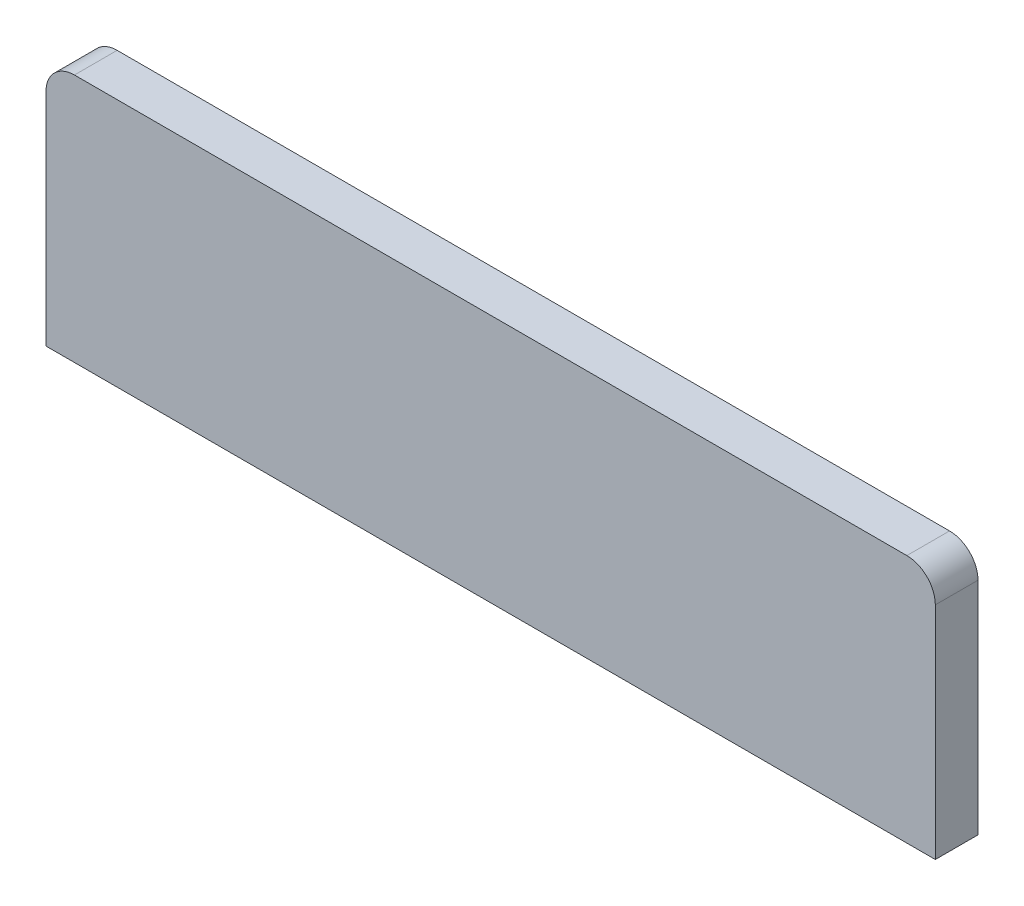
from build123d import *

# Parameters (mm, degrees)
BOSS_EXTRUDE1_DEPTH = 12


with BuildPart() as part:
    # Sketch1 → Boss-Extrude1 (new body)
    with BuildSketch(Plane.XY):
        with BuildLine():
            Line((0, 0), (250, 0))
            Line((250, 0), (250, 62))
            ThreePointArc((250, 62), (247.656854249, 67.656854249), (242, 70))
            Line((242, 70), (8, 70))
            ThreePointArc((8, 70), (2.343145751, 67.656854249), (0, 62))
            Line((0, 62), (0, 0))
        make_face()
    extrude(amount=BOSS_EXTRUDE1_DEPTH)


solid = part.part
